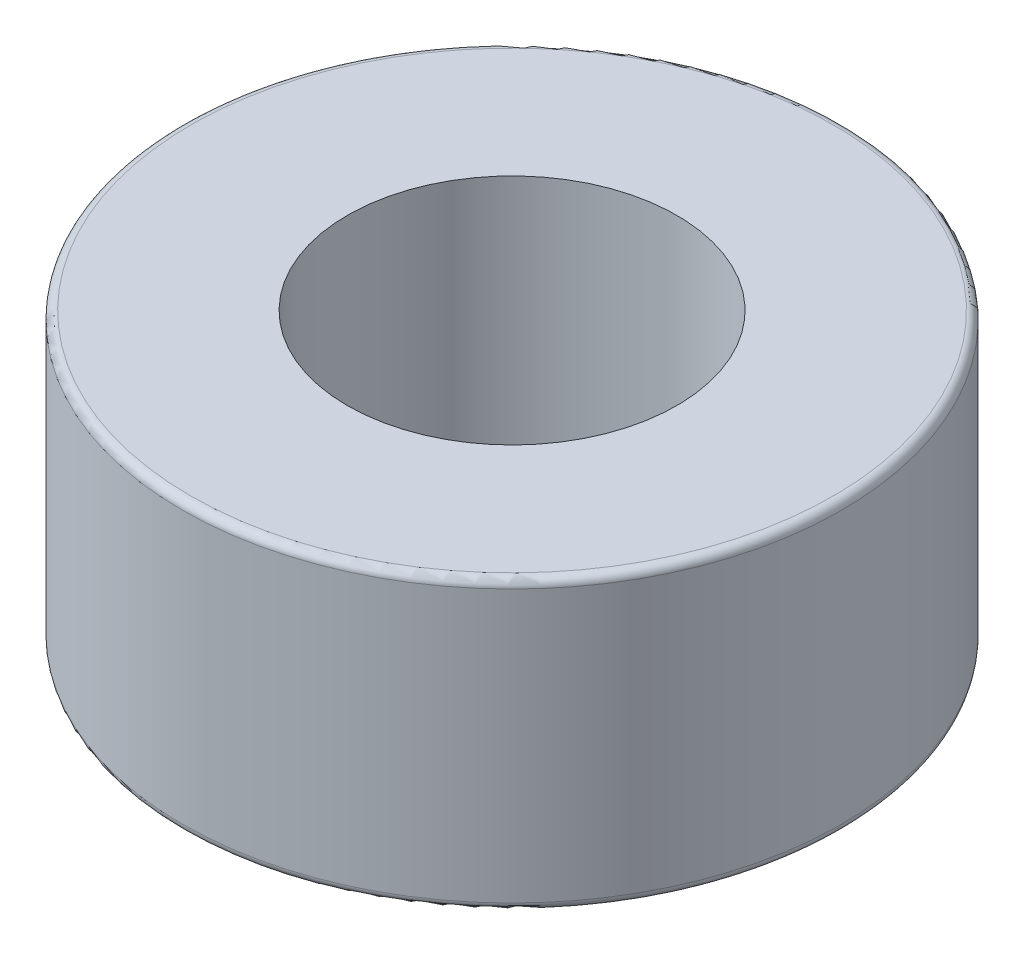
from build123d import *

# Parameters (mm, degrees)
SKETCH1_R           = 8
SKETCH1_R_2         = 4
BOSS_EXTRUDE1_DEPTH = 7
FILLET1_R           = 0.2


with BuildPart() as part:
    # Sketch1 → Boss-Extrude1 (new body)
    with BuildSketch(Plane(origin=(0, 0, 0), x_dir=(1, 0, 0), z_dir=(0, 1, 0))):
        with Locations(Location((0, 0, 0), (0, 0, 270))):
            Circle(SKETCH1_R)
        with Locations(Location((0, 0, 0), (0, 0, 270))):
            Circle(SKETCH1_R_2, mode=Mode.SUBTRACT)
    extrude(amount=BOSS_EXTRUDE1_DEPTH)

    # Fillet1
    fillet1_edges = [part.edges().sort_by_distance(p)[0] for p in [
        (0, 0, -8),
        (0, 7, -8),
    ]]
    fillet(fillet1_edges, radius=FILLET1_R)


solid = part.part
